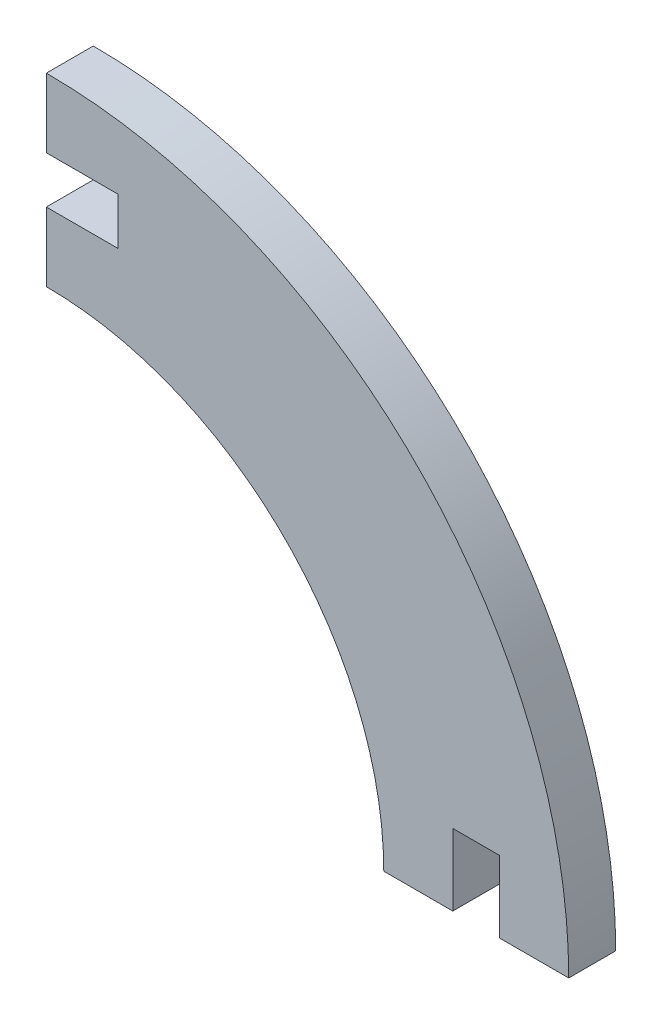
ISO-10303-21;
HEADER;
FILE_DESCRIPTION(('STEP AP214'),'2;1');
FILE_NAME('part.step','',(''),(''),'','','');
FILE_SCHEMA(('AUTOMOTIVE_DESIGN { 1 0 10303 214 1 1 1 1 }'));
ENDSEC;
DATA;
#1=APPLICATION_CONTEXT('core data for automotive mechanical design processes');
#2=APPLICATION_PROTOCOL_DEFINITION('international standard','automotive_design',2000,#1);
#3=PRODUCT_CONTEXT('',#1,'mechanical');
#4=PRODUCT('Part','Part','',(#3));
#5=PRODUCT_RELATED_PRODUCT_CATEGORY('part','',(#4));
#6=PRODUCT_DEFINITION_FORMATION('','',#4);
#7=PRODUCT_DEFINITION_CONTEXT('part definition',#1,'design');
#8=PRODUCT_DEFINITION('design','',#6,#7);
#9=PRODUCT_DEFINITION_SHAPE('','',#8);
#10=(LENGTH_UNIT() NAMED_UNIT(*) SI_UNIT(.MILLI.,.METRE.));
#11=(NAMED_UNIT(*) PLANE_ANGLE_UNIT() SI_UNIT($,.RADIAN.));
#12=(NAMED_UNIT(*) SI_UNIT($,.STERADIAN.) SOLID_ANGLE_UNIT());
#13=UNCERTAINTY_MEASURE_WITH_UNIT(LENGTH_MEASURE(1.E-05),#10,'distance_accuracy_value','');
#14=(GEOMETRIC_REPRESENTATION_CONTEXT(3) GLOBAL_UNCERTAINTY_ASSIGNED_CONTEXT((#13)) GLOBAL_UNIT_ASSIGNED_CONTEXT((#10,
#11,#12)) REPRESENTATION_CONTEXT('',''));
#15=CARTESIAN_POINT('',(0.,0.,0.));
#16=DIRECTION('',(0.,0.,1.));
#17=DIRECTION('',(1.,0.,0.));
#18=AXIS2_PLACEMENT_3D('',#15,#16,#17);
#19=CARTESIAN_POINT('',(-31.4378051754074,34.6108235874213,3.999992));
#20=DIRECTION('',(1.,0.,0.));
#21=DIRECTION('',(0.,0.,-1.));
#22=AXIS2_PLACEMENT_3D('',#19,#20,#21);
#23=PLANE('',#22);
#24=DIRECTION('',(0.,-1.,0.));
#25=VECTOR('',#24,1.);
#26=CARTESIAN_POINT('',(-31.4378051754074,34.6108235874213,0.));
#27=LINE('',#26,#25);
#28=CARTESIAN_POINT('',(-31.4378051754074,38.6108237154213,0.));
#29=VERTEX_POINT('',#28);
#30=CARTESIAN_POINT('',(-31.4378051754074,34.6108235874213,0.));
#31=VERTEX_POINT('',#30);
#32=EDGE_CURVE('E152',#29,#31,#27,.T.);
#33=ORIENTED_EDGE('',*,*,#32,.T.);
#34=DIRECTION('',(0.,0.,-1.));
#35=VECTOR('',#34,1.);
#36=CARTESIAN_POINT('',(-31.4378051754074,34.6108235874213,3.999992));
#37=LINE('',#36,#35);
#38=CARTESIAN_POINT('',(-31.4378051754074,34.6108235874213,3.999992));
#39=VERTEX_POINT('',#38);
#40=EDGE_CURVE('E11',#39,#31,#37,.T.);
#41=ORIENTED_EDGE('',*,*,#40,.F.);
#42=DIRECTION('',(0.,-1.,0.));
#43=VECTOR('',#42,1.);
#44=CARTESIAN_POINT('',(-31.4378051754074,34.6108235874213,3.999992));
#45=LINE('',#44,#43);
#46=CARTESIAN_POINT('',(-31.4378051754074,38.6108237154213,3.999992));
#47=VERTEX_POINT('',#46);
#48=EDGE_CURVE('E174',#47,#39,#45,.T.);
#49=ORIENTED_EDGE('',*,*,#48,.F.);
#50=DIRECTION('',(0.,0.,-1.));
#51=VECTOR('',#50,1.);
#52=CARTESIAN_POINT('',(-31.4378051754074,38.6108237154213,3.999992));
#53=LINE('',#52,#51);
#54=EDGE_CURVE('E148',#47,#29,#53,.T.);
#55=ORIENTED_EDGE('',*,*,#54,.T.);
#56=EDGE_LOOP('',(#33,#41,#49,#55));
#57=FACE_BOUND('',#56,.T.);
#58=ADVANCED_FACE('F32',(#57),#23,.F.);
#59=CARTESIAN_POINT('',(-37.5338051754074,34.6108235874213,3.999992));
#60=DIRECTION('',(0.,-1.,0.));
#61=DIRECTION('',(1.,0.,0.));
#62=AXIS2_PLACEMENT_3D('',#59,#60,#61);
#63=PLANE('',#62);
#64=DIRECTION('',(-1.,0.,0.));
#65=VECTOR('',#64,1.);
#66=CARTESIAN_POINT('',(-37.5338051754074,34.6108235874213,0.));
#67=LINE('',#66,#65);
#68=CARTESIAN_POINT('',(-37.5338051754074,34.6108235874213,0.));
#69=VERTEX_POINT('',#68);
#70=EDGE_CURVE('E155',#31,#69,#67,.T.);
#71=ORIENTED_EDGE('',*,*,#70,.T.);
#72=DIRECTION('',(0.,0.,-1.));
#73=VECTOR('',#72,1.);
#74=CARTESIAN_POINT('',(-37.5338051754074,34.6108235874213,3.999992));
#75=LINE('',#74,#73);
#76=CARTESIAN_POINT('',(-37.5338051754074,34.6108235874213,3.999992));
#77=VERTEX_POINT('',#76);
#78=EDGE_CURVE('E40',#77,#69,#75,.T.);
#79=ORIENTED_EDGE('',*,*,#78,.F.);
#80=DIRECTION('',(-1.,0.,0.));
#81=VECTOR('',#80,1.);
#82=CARTESIAN_POINT('',(-37.5338051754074,34.6108235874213,3.999992));
#83=LINE('',#82,#81);
#84=EDGE_CURVE('E103',#39,#77,#83,.T.);
#85=ORIENTED_EDGE('',*,*,#84,.F.);
#86=ORIENTED_EDGE('',*,*,#40,.T.);
#87=EDGE_LOOP('',(#71,#79,#85,#86));
#88=FACE_BOUND('',#87,.T.);
#89=ADVANCED_FACE('F252',(#88),#63,.F.);
#90=CARTESIAN_POINT('',(-37.5338051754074,28.7368195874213,3.999992));
#91=DIRECTION('',(1.,0.,0.));
#92=DIRECTION('',(0.,0.,-1.));
#93=AXIS2_PLACEMENT_3D('',#90,#91,#92);
#94=PLANE('',#93);
#95=DIRECTION('',(0.,-1.,0.));
#96=VECTOR('',#95,1.);
#97=CARTESIAN_POINT('',(-37.5338051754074,28.7368195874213,0.));
#98=LINE('',#97,#96);
#99=CARTESIAN_POINT('',(-37.5338051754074,28.7368195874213,0.));
#100=VERTEX_POINT('',#99);
#101=EDGE_CURVE('E157',#69,#100,#98,.T.);
#102=ORIENTED_EDGE('',*,*,#101,.T.);
#103=DIRECTION('',(0.,0.,-1.));
#104=VECTOR('',#103,1.);
#105=CARTESIAN_POINT('',(-37.5338051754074,28.7368195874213,3.999992));
#106=LINE('',#105,#104);
#107=CARTESIAN_POINT('',(-37.5338051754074,28.7368195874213,3.999992));
#108=VERTEX_POINT('',#107);
#109=EDGE_CURVE('E193',#108,#100,#106,.T.);
#110=ORIENTED_EDGE('',*,*,#109,.F.);
#111=DIRECTION('',(0.,-1.,0.));
#112=VECTOR('',#111,1.);
#113=CARTESIAN_POINT('',(-37.5338051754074,28.7368195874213,3.999992));
#114=LINE('',#113,#112);
#115=EDGE_CURVE('E201',#77,#108,#114,.T.);
#116=ORIENTED_EDGE('',*,*,#115,.F.);
#117=ORIENTED_EDGE('',*,*,#78,.T.);
#118=EDGE_LOOP('',(#102,#110,#116,#117));
#119=FACE_BOUND('',#118,.T.);
#120=ADVANCED_FACE('F199',(#119),#94,.F.);
#121=CARTESIAN_POINT('',(-37.5338051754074,0.,3.999992));
#122=DIRECTION('',(0.,0.,-1.));
#123=DIRECTION('',(-1.,0.,0.));
#124=AXIS2_PLACEMENT_3D('',#121,#122,#123);
#125=CYLINDRICAL_SURFACE('',#124,28.7368195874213);
#126=CARTESIAN_POINT('',(-37.5338051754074,0.,0.));
#127=DIRECTION('',(0.,0.,-1.));
#128=DIRECTION('',(1.,0.,0.));
#129=AXIS2_PLACEMENT_3D('',#126,#127,#128);
#130=CIRCLE('',#129,28.7368195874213);
#131=CARTESIAN_POINT('',(-8.79698558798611,0.,0.));
#132=VERTEX_POINT('',#131);
#133=EDGE_CURVE('E159',#100,#132,#130,.T.);
#134=ORIENTED_EDGE('',*,*,#133,.T.);
#135=DIRECTION('',(0.,0.,-1.));
#136=VECTOR('',#135,1.);
#137=CARTESIAN_POINT('',(-8.79698558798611,0.,3.999992));
#138=LINE('',#137,#136);
#139=CARTESIAN_POINT('',(-8.79698558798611,0.,3.999992));
#140=VERTEX_POINT('',#139);
#141=EDGE_CURVE('E190',#140,#132,#138,.T.);
#142=ORIENTED_EDGE('',*,*,#141,.F.);
#143=CARTESIAN_POINT('',(-37.5338051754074,0.,3.999992));
#144=DIRECTION('',(0.,0.,-1.));
#145=DIRECTION('',(1.,0.,0.));
#146=AXIS2_PLACEMENT_3D('',#143,#144,#145);
#147=CIRCLE('',#146,28.7368195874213);
#148=EDGE_CURVE('E219',#108,#140,#147,.T.);
#149=ORIENTED_EDGE('',*,*,#148,.F.);
#150=ORIENTED_EDGE('',*,*,#109,.T.);
#151=EDGE_LOOP('',(#134,#142,#149,#150));
#152=FACE_BOUND('',#151,.T.);
#153=ADVANCED_FACE('F210',(#152),#125,.F.);
#154=CARTESIAN_POINT('',(-8.79698558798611,0.,3.999992));
#155=DIRECTION('',(0.,1.,0.));
#156=DIRECTION('',(0.,0.,1.));
#157=AXIS2_PLACEMENT_3D('',#154,#155,#156);
#158=PLANE('',#157);
#159=DIRECTION('',(1.,0.,0.));
#160=VECTOR('',#159,1.);
#161=CARTESIAN_POINT('',(-8.79698558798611,0.,0.));
#162=LINE('',#161,#160);
#163=CARTESIAN_POINT('',(-2.92298158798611,0.,0.));
#164=VERTEX_POINT('',#163);
#165=EDGE_CURVE('E161',#132,#164,#162,.T.);
#166=ORIENTED_EDGE('',*,*,#165,.T.);
#167=DIRECTION('',(0.,0.,-1.));
#168=VECTOR('',#167,1.);
#169=CARTESIAN_POINT('',(-2.92298158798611,0.,3.999992));
#170=LINE('',#169,#168);
#171=CARTESIAN_POINT('',(-2.92298158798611,0.,3.999992));
#172=VERTEX_POINT('',#171);
#173=EDGE_CURVE('E187',#172,#164,#170,.T.);
#174=ORIENTED_EDGE('',*,*,#173,.F.);
#175=DIRECTION('',(1.,0.,0.));
#176=VECTOR('',#175,1.);
#177=CARTESIAN_POINT('',(-8.79698558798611,0.,3.999992));
#178=LINE('',#177,#176);
#179=EDGE_CURVE('E216',#140,#172,#178,.T.);
#180=ORIENTED_EDGE('',*,*,#179,.F.);
#181=ORIENTED_EDGE('',*,*,#141,.T.);
#182=EDGE_LOOP('',(#166,#174,#180,#181));
#183=FACE_BOUND('',#182,.T.);
#184=ADVANCED_FACE('F214',(#183),#158,.F.);
#185=CARTESIAN_POINT('',(-2.92298158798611,0.,3.999992));
#186=DIRECTION('',(-1.,0.,0.));
#187=DIRECTION('',(0.,0.,1.));
#188=AXIS2_PLACEMENT_3D('',#185,#186,#187);
#189=PLANE('',#188);
#190=DIRECTION('',(0.,1.,0.));
#191=VECTOR('',#190,1.);
#192=CARTESIAN_POINT('',(-2.92298158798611,0.,0.));
#193=LINE('',#192,#191);
#194=CARTESIAN_POINT('',(-2.92298158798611,6.096,0.));
#195=VERTEX_POINT('',#194);
#196=EDGE_CURVE('E163',#164,#195,#193,.T.);
#197=ORIENTED_EDGE('',*,*,#196,.T.);
#198=DIRECTION('',(0.,0.,-1.));
#199=VECTOR('',#198,1.);
#200=CARTESIAN_POINT('',(-2.92298158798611,6.096,3.999992));
#201=LINE('',#200,#199);
#202=CARTESIAN_POINT('',(-2.92298158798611,6.096,3.999992));
#203=VERTEX_POINT('',#202);
#204=EDGE_CURVE('E184',#203,#195,#201,.T.);
#205=ORIENTED_EDGE('',*,*,#204,.F.);
#206=DIRECTION('',(0.,1.,0.));
#207=VECTOR('',#206,1.);
#208=CARTESIAN_POINT('',(-2.92298158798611,0.,3.999992));
#209=LINE('',#208,#207);
#210=EDGE_CURVE('E218',#172,#203,#209,.T.);
#211=ORIENTED_EDGE('',*,*,#210,.F.);
#212=ORIENTED_EDGE('',*,*,#173,.T.);
#213=EDGE_LOOP('',(#197,#205,#211,#212));
#214=FACE_BOUND('',#213,.T.);
#215=ADVANCED_FACE('F265',(#214),#189,.F.);
#216=CARTESIAN_POINT('',(-2.92298158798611,6.096,3.999992));
#217=DIRECTION('',(0.,1.,0.));
#218=DIRECTION('',(0.,0.,1.));
#219=AXIS2_PLACEMENT_3D('',#216,#217,#218);
#220=PLANE('',#219);
#221=DIRECTION('',(1.,0.,0.));
#222=VECTOR('',#221,1.);
#223=CARTESIAN_POINT('',(-2.92298158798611,6.096,0.));
#224=LINE('',#223,#222);
#225=CARTESIAN_POINT('',(1.07701854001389,6.096,0.));
#226=VERTEX_POINT('',#225);
#227=EDGE_CURVE('E165',#195,#226,#224,.T.);
#228=ORIENTED_EDGE('',*,*,#227,.T.);
#229=DIRECTION('',(0.,0.,-1.));
#230=VECTOR('',#229,1.);
#231=CARTESIAN_POINT('',(1.07701854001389,6.096,3.999992));
#232=LINE('',#231,#230);
#233=CARTESIAN_POINT('',(1.07701854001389,6.096,3.999992));
#234=VERTEX_POINT('',#233);
#235=EDGE_CURVE('E181',#234,#226,#232,.T.);
#236=ORIENTED_EDGE('',*,*,#235,.F.);
#237=DIRECTION('',(1.,0.,0.));
#238=VECTOR('',#237,1.);
#239=CARTESIAN_POINT('',(-2.92298158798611,6.096,3.999992));
#240=LINE('',#239,#238);
#241=EDGE_CURVE('E221',#203,#234,#240,.T.);
#242=ORIENTED_EDGE('',*,*,#241,.F.);
#243=ORIENTED_EDGE('',*,*,#204,.T.);
#244=EDGE_LOOP('',(#228,#236,#242,#243));
#245=FACE_BOUND('',#244,.T.);
#246=ADVANCED_FACE('F268',(#245),#220,.F.);
#247=CARTESIAN_POINT('',(1.07701854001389,6.096,3.999992));
#248=DIRECTION('',(1.,0.,0.));
#249=DIRECTION('',(0.,1.,0.));
#250=AXIS2_PLACEMENT_3D('',#247,#248,#249);
#251=PLANE('',#250);
#252=DIRECTION('',(0.,-1.,0.));
#253=VECTOR('',#252,1.);
#254=CARTESIAN_POINT('',(1.07701854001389,6.096,0.));
#255=LINE('',#254,#253);
#256=CARTESIAN_POINT('',(1.07701854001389,0.,0.));
#257=VERTEX_POINT('',#256);
#258=EDGE_CURVE('E167',#226,#257,#255,.T.);
#259=ORIENTED_EDGE('',*,*,#258,.T.);
#260=DIRECTION('',(0.,0.,-1.));
#261=VECTOR('',#260,1.);
#262=CARTESIAN_POINT('',(1.07701854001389,0.,3.999992));
#263=LINE('',#262,#261);
#264=CARTESIAN_POINT('',(1.07701854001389,0.,3.999992));
#265=VERTEX_POINT('',#264);
#266=EDGE_CURVE('E178',#265,#257,#263,.T.);
#267=ORIENTED_EDGE('',*,*,#266,.F.);
#268=DIRECTION('',(0.,-1.,0.));
#269=VECTOR('',#268,1.);
#270=CARTESIAN_POINT('',(1.07701854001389,6.096,3.999992));
#271=LINE('',#270,#269);
#272=EDGE_CURVE('E227',#234,#265,#271,.T.);
#273=ORIENTED_EDGE('',*,*,#272,.F.);
#274=ORIENTED_EDGE('',*,*,#235,.T.);
#275=EDGE_LOOP('',(#259,#267,#273,#274));
#276=FACE_BOUND('',#275,.T.);
#277=ADVANCED_FACE('F233',(#276),#251,.F.);
#278=CARTESIAN_POINT('',(1.07701854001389,0.,3.999992));
#279=DIRECTION('',(0.,1.,0.));
#280=DIRECTION('',(-1.,0.,0.));
#281=AXIS2_PLACEMENT_3D('',#278,#279,#280);
#282=PLANE('',#281);
#283=DIRECTION('',(1.,0.,0.));
#284=VECTOR('',#283,1.);
#285=CARTESIAN_POINT('',(1.07701854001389,0.,0.));
#286=LINE('',#285,#284);
#287=CARTESIAN_POINT('',(6.95102254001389,0.,0.));
#288=VERTEX_POINT('',#287);
#289=EDGE_CURVE('E169',#257,#288,#286,.T.);
#290=ORIENTED_EDGE('',*,*,#289,.T.);
#291=DIRECTION('',(0.,0.,-1.));
#292=VECTOR('',#291,1.);
#293=CARTESIAN_POINT('',(6.95102254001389,0.,3.999992));
#294=LINE('',#293,#292);
#295=CARTESIAN_POINT('',(6.95102254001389,0.,3.999992));
#296=VERTEX_POINT('',#295);
#297=EDGE_CURVE('E143',#296,#288,#294,.T.);
#298=ORIENTED_EDGE('',*,*,#297,.F.);
#299=DIRECTION('',(1.,0.,0.));
#300=VECTOR('',#299,1.);
#301=CARTESIAN_POINT('',(1.07701854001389,0.,3.999992));
#302=LINE('',#301,#300);
#303=EDGE_CURVE('E134',#265,#296,#302,.T.);
#304=ORIENTED_EDGE('',*,*,#303,.F.);
#305=ORIENTED_EDGE('',*,*,#266,.T.);
#306=EDGE_LOOP('',(#290,#298,#304,#305));
#307=FACE_BOUND('',#306,.T.);
#308=ADVANCED_FACE('F237',(#307),#282,.F.);
#309=CARTESIAN_POINT('',(-37.5338051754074,0.,3.999992));
#310=DIRECTION('',(0.,0.,-1.));
#311=DIRECTION('',(-1.,0.,0.));
#312=AXIS2_PLACEMENT_3D('',#309,#310,#311);
#313=CYLINDRICAL_SURFACE('',#312,44.4848277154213);
#314=CARTESIAN_POINT('',(-37.5338051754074,0.,0.));
#315=DIRECTION('',(0.,0.,1.));
#316=DIRECTION('',(-1.,0.,0.));
#317=AXIS2_PLACEMENT_3D('',#314,#315,#316);
#318=CIRCLE('',#317,44.4848277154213);
#319=CARTESIAN_POINT('',(-37.5338051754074,44.4848277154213,0.));
#320=VERTEX_POINT('',#319);
#321=EDGE_CURVE('E142',#288,#320,#318,.T.);
#322=ORIENTED_EDGE('',*,*,#321,.T.);
#323=DIRECTION('',(0.,0.,-1.));
#324=VECTOR('',#323,1.);
#325=CARTESIAN_POINT('',(-37.5338051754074,44.4848277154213,3.999992));
#326=LINE('',#325,#324);
#327=CARTESIAN_POINT('',(-37.5338051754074,44.4848277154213,3.999992));
#328=VERTEX_POINT('',#327);
#329=EDGE_CURVE('E139',#328,#320,#326,.T.);
#330=ORIENTED_EDGE('',*,*,#329,.F.);
#331=CARTESIAN_POINT('',(-37.5338051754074,0.,3.999992));
#332=DIRECTION('',(0.,0.,1.));
#333=DIRECTION('',(-1.,0.,0.));
#334=AXIS2_PLACEMENT_3D('',#331,#332,#333);
#335=CIRCLE('',#334,44.4848277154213);
#336=EDGE_CURVE('E128',#296,#328,#335,.T.);
#337=ORIENTED_EDGE('',*,*,#336,.F.);
#338=ORIENTED_EDGE('',*,*,#297,.T.);
#339=EDGE_LOOP('',(#322,#330,#337,#338));
#340=FACE_BOUND('',#339,.T.);
#341=ADVANCED_FACE('F140',(#340),#313,.T.);
#342=CARTESIAN_POINT('',(-37.5338051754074,38.6108237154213,3.999992));
#343=DIRECTION('',(1.,0.,0.));
#344=DIRECTION('',(0.,0.,-1.));
#345=AXIS2_PLACEMENT_3D('',#342,#343,#344);
#346=PLANE('',#345);
#347=DIRECTION('',(0.,-1.,0.));
#348=VECTOR('',#347,1.);
#349=CARTESIAN_POINT('',(-37.5338051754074,38.6108237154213,0.));
#350=LINE('',#349,#348);
#351=CARTESIAN_POINT('',(-37.5338051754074,38.6108237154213,0.));
#352=VERTEX_POINT('',#351);
#353=EDGE_CURVE('E89',#320,#352,#350,.T.);
#354=ORIENTED_EDGE('',*,*,#353,.T.);
#355=DIRECTION('',(0.,0.,-1.));
#356=VECTOR('',#355,1.);
#357=CARTESIAN_POINT('',(-37.5338051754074,38.6108237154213,3.999992));
#358=LINE('',#357,#356);
#359=CARTESIAN_POINT('',(-37.5338051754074,38.6108237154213,3.999992));
#360=VERTEX_POINT('',#359);
#361=EDGE_CURVE('E144',#360,#352,#358,.T.);
#362=ORIENTED_EDGE('',*,*,#361,.F.);
#363=DIRECTION('',(0.,-1.,0.));
#364=VECTOR('',#363,1.);
#365=CARTESIAN_POINT('',(-37.5338051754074,38.6108237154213,3.999992));
#366=LINE('',#365,#364);
#367=EDGE_CURVE('E132',#328,#360,#366,.T.);
#368=ORIENTED_EDGE('',*,*,#367,.F.);
#369=ORIENTED_EDGE('',*,*,#329,.T.);
#370=EDGE_LOOP('',(#354,#362,#368,#369));
#371=FACE_BOUND('',#370,.T.);
#372=ADVANCED_FACE('F146',(#371),#346,.F.);
#373=CARTESIAN_POINT('',(-31.4378051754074,38.6108237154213,3.999992));
#374=DIRECTION('',(0.,1.,0.));
#375=DIRECTION('',(0.,0.,1.));
#376=AXIS2_PLACEMENT_3D('',#373,#374,#375);
#377=PLANE('',#376);
#378=DIRECTION('',(1.,0.,0.));
#379=VECTOR('',#378,1.);
#380=CARTESIAN_POINT('',(-31.4378051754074,38.6108237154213,0.));
#381=LINE('',#380,#379);
#382=EDGE_CURVE('E95',#352,#29,#381,.T.);
#383=ORIENTED_EDGE('',*,*,#382,.T.);
#384=ORIENTED_EDGE('',*,*,#54,.F.);
#385=DIRECTION('',(1.,0.,0.));
#386=VECTOR('',#385,1.);
#387=CARTESIAN_POINT('',(-31.4378051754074,38.6108237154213,3.999992));
#388=LINE('',#387,#386);
#389=EDGE_CURVE('E48',#360,#47,#388,.T.);
#390=ORIENTED_EDGE('',*,*,#389,.F.);
#391=ORIENTED_EDGE('',*,*,#361,.T.);
#392=EDGE_LOOP('',(#383,#384,#390,#391));
#393=FACE_BOUND('',#392,.T.);
#394=ADVANCED_FACE('F241',(#393),#377,.F.);
#395=CARTESIAN_POINT('',(-37.5338051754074,0.,3.999992));
#396=DIRECTION('',(0.,0.,-1.));
#397=DIRECTION('',(-1.,0.,0.));
#398=AXIS2_PLACEMENT_3D('',#395,#396,#397);
#399=PLANE('',#398);
#400=ORIENTED_EDGE('',*,*,#48,.T.);
#401=ORIENTED_EDGE('',*,*,#84,.T.);
#402=ORIENTED_EDGE('',*,*,#115,.T.);
#403=ORIENTED_EDGE('',*,*,#148,.T.);
#404=ORIENTED_EDGE('',*,*,#179,.T.);
#405=ORIENTED_EDGE('',*,*,#210,.T.);
#406=ORIENTED_EDGE('',*,*,#241,.T.);
#407=ORIENTED_EDGE('',*,*,#272,.T.);
#408=ORIENTED_EDGE('',*,*,#303,.T.);
#409=ORIENTED_EDGE('',*,*,#336,.T.);
#410=ORIENTED_EDGE('',*,*,#367,.T.);
#411=ORIENTED_EDGE('',*,*,#389,.T.);
#412=EDGE_LOOP('',(#400,#401,#402,#403,#404,#405,#406,#407,#408,#409,#410,#411));
#413=FACE_BOUND('',#412,.T.);
#414=ADVANCED_FACE('F130',(#413),#399,.F.);
#415=CARTESIAN_POINT('',(-37.5338051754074,0.,0.));
#416=DIRECTION('',(0.,0.,-1.));
#417=DIRECTION('',(-1.,0.,0.));
#418=AXIS2_PLACEMENT_3D('',#415,#416,#417);
#419=PLANE('',#418);
#420=ORIENTED_EDGE('',*,*,#32,.F.);
#421=ORIENTED_EDGE('',*,*,#382,.F.);
#422=ORIENTED_EDGE('',*,*,#353,.F.);
#423=ORIENTED_EDGE('',*,*,#321,.F.);
#424=ORIENTED_EDGE('',*,*,#289,.F.);
#425=ORIENTED_EDGE('',*,*,#258,.F.);
#426=ORIENTED_EDGE('',*,*,#227,.F.);
#427=ORIENTED_EDGE('',*,*,#196,.F.);
#428=ORIENTED_EDGE('',*,*,#165,.F.);
#429=ORIENTED_EDGE('',*,*,#133,.F.);
#430=ORIENTED_EDGE('',*,*,#101,.F.);
#431=ORIENTED_EDGE('',*,*,#70,.F.);
#432=EDGE_LOOP('',(#420,#421,#422,#423,#424,#425,#426,#427,#428,#429,#430,#431));
#433=FACE_BOUND('',#432,.T.);
#434=ADVANCED_FACE('F205',(#433),#419,.T.);
#435=CLOSED_SHELL('',(#58,#89,#120,#153,#184,#215,#246,#277,#308,#341,#372,#394,#414,#434));
#436=MANIFOLD_SOLID_BREP('B2',#435);
#437=ADVANCED_BREP_SHAPE_REPRESENTATION('',(#18,#436),#14);
#438=SHAPE_DEFINITION_REPRESENTATION(#9,#437);
ENDSEC;
END-ISO-10303-21;
